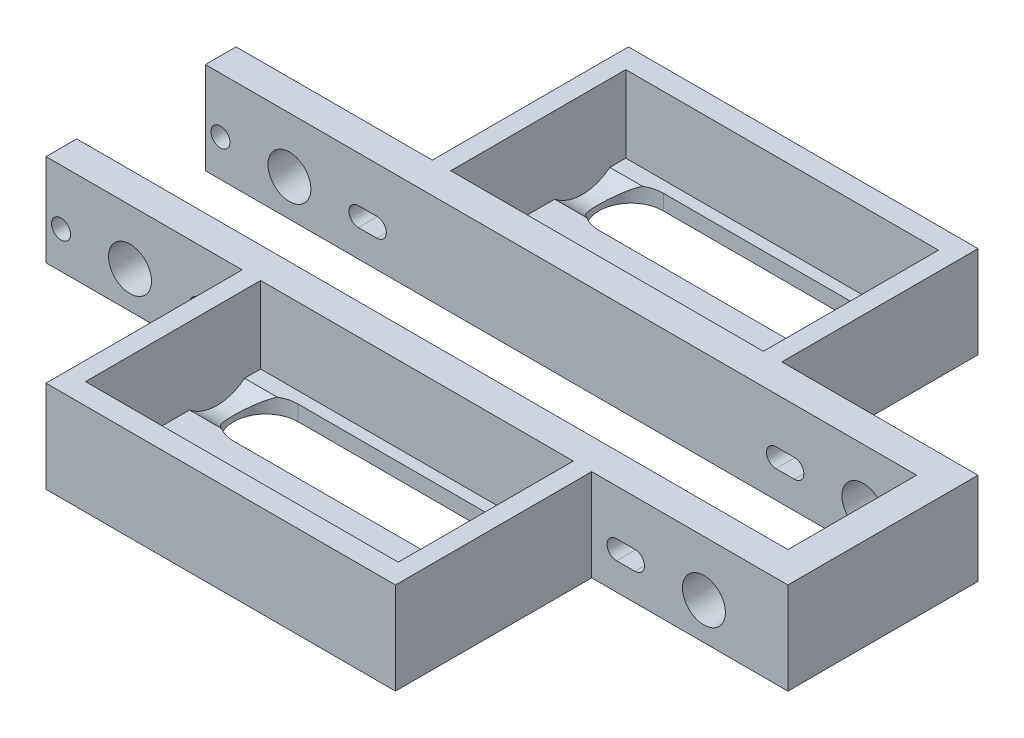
from build123d import *

# Parameters (mm, degrees)
SKETCH1_W                  = 51
SKETCH1_H                  = 28.56
TOTALHEIGHT_DEPTH          = 15
SKETCH1_3_W                = 51
SKETCH1_3_H                = 28.56
FLOORHEIGHT_DEPTH          = 2.5
HOLESFORBEARINGMOUNT_REACH = 139.241
SKETCH2_R                  = 1.55
SKETCH2_R_2                = 3.5
CUT_EXTRUDE2_REACH         = 131.019


with BuildPart() as part:
    # Sketch1 → TotalHeight (new body)
    with BuildSketch(Plane(origin=(0, 0, 0), x_dir=(1, 0, 0), z_dir=(0, 1, 0))):
        Polygon((32, 32), (32, 0), (89, 0), (89, 32), (121, 32), (121, 47.5), (121, 63), (89, 63), (89, 95), (32, 95), (32, 63), (0, 63), (0, 58), (5, 58), (116, 58), (116, 37), (5, 37), (0, 37), (0, 32), align=None)
        with Locations((60.5, 17.72)):
            Rectangle(SKETCH1_W, SKETCH1_H, mode=Mode.SUBTRACT)
        with Locations((60.5, 77.28)):
            Rectangle(SKETCH1_W, SKETCH1_H, mode=Mode.SUBTRACT)
    extrude(amount=TOTALHEIGHT_DEPTH)

    # Sketch1_3 → FloorHeight (add)
    # profile 1 of 2: a face of its own
    with BuildSketch(Plane(origin=(0, 0, 0), x_dir=(1, 0, 0), z_dir=(0, 1, 0))):
        with Locations((60.5, 77.28)):
            Rectangle(SKETCH1_3_W, SKETCH1_3_H)
        with BuildLine():
            ThreePointArc((78, 79.17), (83.25, 84.42), (78, 89.67))
            Line((78, 89.67), (43, 89.67))
            ThreePointArc((43, 89.67), (37.75, 84.42), (43, 79.17))
            Line((43, 79.17), (78, 79.17))
        make_face(mode=Mode.SUBTRACT)
        with BuildLine():
            Line((43, 75.39), (78, 75.39))
            ThreePointArc((78, 75.39), (83.25, 70.14), (78, 64.89))
            Line((78, 64.89), (43, 64.89))
            ThreePointArc((43, 64.89), (37.75, 70.14), (43, 75.39))
        make_face(mode=Mode.SUBTRACT)
    # profile 2 of 2: a face of its own
    with BuildSketch(Plane(origin=(0, 0, 0), x_dir=(1, 0, 0), z_dir=(0, 1, 0))):
        with Locations((60.5, 17.72)):
            Rectangle(SKETCH1_3_W, SKETCH1_3_H)
        with BuildLine():
            ThreePointArc((78, 19.61), (83.25, 24.86), (78, 30.11))
            Line((78, 30.11), (43, 30.11))
            ThreePointArc((43, 30.11), (37.75, 24.86), (43, 19.61))
            Line((43, 19.61), (78, 19.61))
        make_face(mode=Mode.SUBTRACT)
        with BuildLine():
            Line((43, 15.83), (78, 15.83))
            ThreePointArc((78, 15.83), (83.25, 10.58), (78, 5.33))
            Line((78, 5.33), (43, 5.33))
            ThreePointArc((43, 5.33), (37.75, 10.58), (43, 15.83))
        make_face(mode=Mode.SUBTRACT)
    extrude(amount=FLOORHEIGHT_DEPTH)

    # HolesForBearingMount: up to this face of the body (flat: up to its plane)
    holesforbearingmount_end = Plane(part.part.faces().sort_by_distance((16, 7.5, -63))[0])
    # Sketch2 → HolesForBearingMount (cut, up to the picked face)
    with BuildSketch(Plane.XY.offset(-32), mode=Mode.PRIVATE) as holesforbearingmount_sk1:
        with Locations((2.45, 6)):
            Circle(SKETCH2_R)
    holesforbearingmount_tool1 = split(extrude(holesforbearingmount_sk1.sketch, amount=-HOLESFORBEARINGMOUNT_REACH, mode=Mode.PRIVATE), bisect_by=holesforbearingmount_end, keep=Keep.BOTH, mode=Mode.PRIVATE)
    # Sketch2 → HolesForBearingMount (cut, up to the picked face)
    with BuildSketch(Plane.XY.offset(-32), mode=Mode.PRIVATE) as holesforbearingmount_sk2:
        with Locations((13.7, 6)):
            Circle(SKETCH2_R_2)
    holesforbearingmount_tool2 = split(extrude(holesforbearingmount_sk2.sketch, amount=-HOLESFORBEARINGMOUNT_REACH, mode=Mode.PRIVATE), bisect_by=holesforbearingmount_end, keep=Keep.BOTH, mode=Mode.PRIVATE)
    # Sketch2 → HolesForBearingMount (cut, up to the picked face)
    with BuildSketch(Plane.XY.offset(-32), mode=Mode.PRIVATE) as holesforbearingmount_sk3:
        with BuildLine():
            Line((24.95, 4.45), (27.95, 4.45))
            ThreePointArc((27.95, 4.45), (29.5, 6), (27.95, 7.55))
            Line((27.95, 7.55), (24.95, 7.55))
            ThreePointArc((24.95, 7.55), (23.4, 6), (24.95, 4.45))
        make_face()
    holesforbearingmount_tool3 = split(extrude(holesforbearingmount_sk3.sketch, amount=-HOLESFORBEARINGMOUNT_REACH, mode=Mode.PRIVATE), bisect_by=holesforbearingmount_end, keep=Keep.BOTH, mode=Mode.PRIVATE)
    # Sketch2 → HolesForBearingMount (cut, up to the picked face)
    with BuildSketch(Plane.XY.offset(-32), mode=Mode.PRIVATE) as holesforbearingmount_sk4:
        with BuildLine():
            ThreePointArc((93.05, 4.45), (91.5, 6), (93.05, 7.55))
            Line((93.05, 7.55), (96.05, 7.55))
            ThreePointArc((96.05, 7.55), (97.6, 6), (96.05, 4.45))
            Line((96.05, 4.45), (93.05, 4.45))
        make_face()
    holesforbearingmount_tool4 = split(extrude(holesforbearingmount_sk4.sketch, amount=-HOLESFORBEARINGMOUNT_REACH, mode=Mode.PRIVATE), bisect_by=holesforbearingmount_end, keep=Keep.BOTH, mode=Mode.PRIVATE)
    # Sketch2 → HolesForBearingMount (cut, up to the picked face)
    with BuildSketch(Plane.XY.offset(-32), mode=Mode.PRIVATE) as holesforbearingmount_sk5:
        with Locations((107.3, 6)):
            Circle(SKETCH2_R_2)
    holesforbearingmount_tool5 = split(extrude(holesforbearingmount_sk5.sketch, amount=-HOLESFORBEARINGMOUNT_REACH, mode=Mode.PRIVATE), bisect_by=holesforbearingmount_end, keep=Keep.BOTH, mode=Mode.PRIVATE)
    add(holesforbearingmount_tool1.solids().sort_by(Axis((2.45, 6, -32), (0, 0, -1)))[0], mode=Mode.SUBTRACT)
    add(holesforbearingmount_tool2.solids().sort_by(Axis((13.7, 6, -32), (0, 0, -1)))[0], mode=Mode.SUBTRACT)
    add(holesforbearingmount_tool3.solids().sort_by(Axis((26.45, 6, -32), (0, 0, -1)))[0], mode=Mode.SUBTRACT)
    add(holesforbearingmount_tool4.solids().sort_by(Axis((94.55, 6, -32), (0, 0, -1)))[0], mode=Mode.SUBTRACT)
    add(holesforbearingmount_tool5.solids().sort_by(Axis((107.3, 6, -32), (0, 0, -1)))[0], mode=Mode.SUBTRACT)

    # Cut-Extrude2: up to this face of the body (flat: up to its plane)
    cut_extrude2_end = Plane(part.part.faces().sort_by_distance((35, 8.75, -17.72))[0])
    # Sketch3 → Cut-Extrude2 (cut, up to the picked face)
    with BuildSketch(Plane.ZY.offset(-86), mode=Mode.PRIVATE) as cut_extrude2_sk1:
        with BuildLine():
            ThreePointArc((-77.36, 8), (-87.503934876, 14.414394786), (-88.949988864, 2.5))
            Line((-88.949988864, 2.5), (-79.970011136, 2.5))
            ThreePointArc((-79.970011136, 2.5), (-78.045605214, 4.956065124), (-77.36, 8))
        make_face()
    cut_extrude2_tool1 = split(extrude(cut_extrude2_sk1.sketch, amount=CUT_EXTRUDE2_REACH, mode=Mode.PRIVATE), bisect_by=cut_extrude2_end, keep=Keep.BOTH, mode=Mode.PRIVATE)
    # Sketch3 → Cut-Extrude2 (cut, up to the picked face)
    with BuildSketch(Plane.ZY.offset(-86), mode=Mode.PRIVATE) as cut_extrude2_sk2:
        with BuildLine():
            Line((-79.970011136, 2.5), (-88.949988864, 2.5))
            ThreePointArc((-88.949988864, 2.5), (-84.46, 0.9), (-79.970011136, 2.5))
        make_face()
    cut_extrude2_tool2 = split(extrude(cut_extrude2_sk2.sketch, amount=CUT_EXTRUDE2_REACH, mode=Mode.PRIVATE), bisect_by=cut_extrude2_end, keep=Keep.BOTH, mode=Mode.PRIVATE)
    # Sketch3 → Cut-Extrude2 (cut, up to the picked face)
    with BuildSketch(Plane.ZY.offset(-86), mode=Mode.PRIVATE) as cut_extrude2_sk3:
        with BuildLine():
            ThreePointArc((-63, 8), (-73.143934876, 14.414394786), (-74.589988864, 2.5))
            Line((-74.589988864, 2.5), (-65.610011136, 2.5))
            ThreePointArc((-65.610011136, 2.5), (-63.685605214, 4.956065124), (-63, 8))
        make_face()
    cut_extrude2_tool3 = split(extrude(cut_extrude2_sk3.sketch, amount=CUT_EXTRUDE2_REACH, mode=Mode.PRIVATE), bisect_by=cut_extrude2_end, keep=Keep.BOTH, mode=Mode.PRIVATE)
    # Sketch3 → Cut-Extrude2 (cut, up to the picked face)
    with BuildSketch(Plane.ZY.offset(-86), mode=Mode.PRIVATE) as cut_extrude2_sk4:
        with BuildLine():
            Line((-65.610011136, 2.5), (-74.589988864, 2.5))
            ThreePointArc((-74.589988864, 2.5), (-70.1, 0.9), (-65.610011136, 2.5))
        make_face()
    cut_extrude2_tool4 = split(extrude(cut_extrude2_sk4.sketch, amount=CUT_EXTRUDE2_REACH, mode=Mode.PRIVATE), bisect_by=cut_extrude2_end, keep=Keep.BOTH, mode=Mode.PRIVATE)
    # Sketch3 → Cut-Extrude2 (cut, up to the picked face)
    with BuildSketch(Plane.ZY.offset(-86), mode=Mode.PRIVATE) as cut_extrude2_sk5:
        with BuildLine():
            ThreePointArc((-17.8, 8), (-27.943934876, 14.414394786), (-29.389988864, 2.5))
            Line((-29.389988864, 2.5), (-20.410011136, 2.5))
            ThreePointArc((-20.410011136, 2.5), (-18.485605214, 4.956065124), (-17.8, 8))
        make_face()
    cut_extrude2_tool5 = split(extrude(cut_extrude2_sk5.sketch, amount=CUT_EXTRUDE2_REACH, mode=Mode.PRIVATE), bisect_by=cut_extrude2_end, keep=Keep.BOTH, mode=Mode.PRIVATE)
    # Sketch3 → Cut-Extrude2 (cut, up to the picked face)
    with BuildSketch(Plane.ZY.offset(-86), mode=Mode.PRIVATE) as cut_extrude2_sk6:
        with BuildLine():
            Line((-20.410011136, 2.5), (-29.389988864, 2.5))
            ThreePointArc((-29.389988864, 2.5), (-24.9, 0.9), (-20.410011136, 2.5))
        make_face()
    cut_extrude2_tool6 = split(extrude(cut_extrude2_sk6.sketch, amount=CUT_EXTRUDE2_REACH, mode=Mode.PRIVATE), bisect_by=cut_extrude2_end, keep=Keep.BOTH, mode=Mode.PRIVATE)
    # Sketch3 → Cut-Extrude2 (cut, up to the picked face)
    with BuildSketch(Plane.ZY.offset(-86), mode=Mode.PRIVATE) as cut_extrude2_sk7:
        with BuildLine():
            ThreePointArc((-3.44, 8), (-13.583934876, 14.414394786), (-15.029988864, 2.5))
            Line((-15.029988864, 2.5), (-6.050011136, 2.5))
            ThreePointArc((-6.050011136, 2.5), (-4.125605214, 4.956065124), (-3.44, 8))
        make_face()
    cut_extrude2_tool7 = split(extrude(cut_extrude2_sk7.sketch, amount=CUT_EXTRUDE2_REACH, mode=Mode.PRIVATE), bisect_by=cut_extrude2_end, keep=Keep.BOTH, mode=Mode.PRIVATE)
    # Sketch3 → Cut-Extrude2 (cut, up to the picked face)
    with BuildSketch(Plane.ZY.offset(-86), mode=Mode.PRIVATE) as cut_extrude2_sk8:
        with BuildLine():
            Line((-6.050011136, 2.5), (-15.029988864, 2.5))
            ThreePointArc((-15.029988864, 2.5), (-10.54, 0.9), (-6.050011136, 2.5))
        make_face()
    cut_extrude2_tool8 = split(extrude(cut_extrude2_sk8.sketch, amount=CUT_EXTRUDE2_REACH, mode=Mode.PRIVATE), bisect_by=cut_extrude2_end, keep=Keep.BOTH, mode=Mode.PRIVATE)
    add(cut_extrude2_tool1.solids().sort_by(Axis((86, 8.40623, -84.46), (-1, 0, 0)))[0], mode=Mode.SUBTRACT)
    add(cut_extrude2_tool2.solids().sort_by(Axis((86, 1.853386, -84.46), (-1, 0, 0)))[0], mode=Mode.SUBTRACT)
    add(cut_extrude2_tool3.solids().sort_by(Axis((86, 8.40623, -70.1), (-1, 0, 0)))[0], mode=Mode.SUBTRACT)
    add(cut_extrude2_tool4.solids().sort_by(Axis((86, 1.853386, -70.1), (-1, 0, 0)))[0], mode=Mode.SUBTRACT)
    add(cut_extrude2_tool5.solids().sort_by(Axis((86, 8.40623, -24.9), (-1, 0, 0)))[0], mode=Mode.SUBTRACT)
    add(cut_extrude2_tool6.solids().sort_by(Axis((86, 1.853386, -24.9), (-1, 0, 0)))[0], mode=Mode.SUBTRACT)
    add(cut_extrude2_tool7.solids().sort_by(Axis((86, 8.40623, -10.54), (-1, 0, 0)))[0], mode=Mode.SUBTRACT)
    add(cut_extrude2_tool8.solids().sort_by(Axis((86, 1.853386, -10.54), (-1, 0, 0)))[0], mode=Mode.SUBTRACT)


solid = part.part
